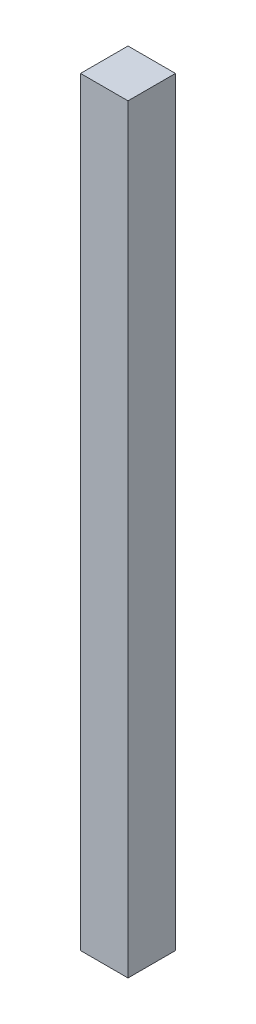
from build123d import *

# Parameters (mm, degrees)
SKETCH1_W           = 50.8
SKETCH1_H           = 50.8
BOSS_EXTRUDE1_DEPTH = 812.8


with BuildPart() as part:
    # Sketch1 → Boss-Extrude1 (new body)
    with BuildSketch(Plane(origin=(0, 0, 0), x_dir=(1, 0, 0), z_dir=(0, 1, 0))):
        Rectangle(SKETCH1_W, SKETCH1_H)
    extrude(amount=BOSS_EXTRUDE1_DEPTH)


solid = part.part
